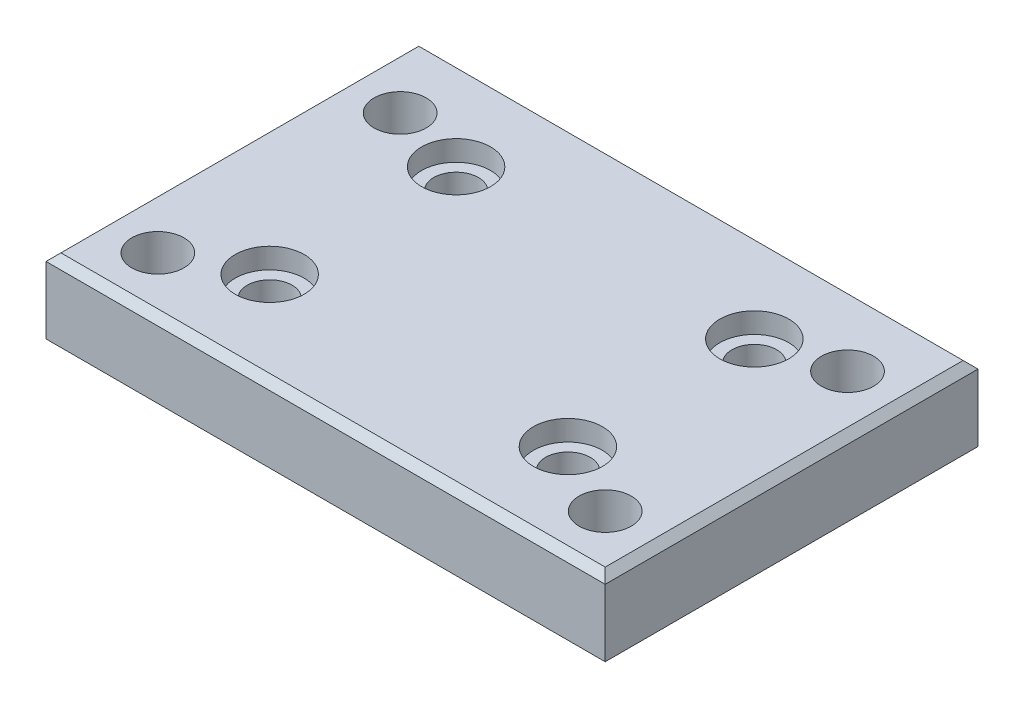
ISO-10303-21;
HEADER;
FILE_DESCRIPTION(('STEP AP214'),'2;1');
FILE_NAME('part.step','',(''),(''),'','','');
FILE_SCHEMA(('AUTOMOTIVE_DESIGN { 1 0 10303 214 1 1 1 1 }'));
ENDSEC;
DATA;
#1=APPLICATION_CONTEXT('core data for automotive mechanical design processes');
#2=APPLICATION_PROTOCOL_DEFINITION('international standard','automotive_design',2000,#1);
#3=PRODUCT_CONTEXT('',#1,'mechanical');
#4=PRODUCT('Part','Part','',(#3));
#5=PRODUCT_RELATED_PRODUCT_CATEGORY('part','',(#4));
#6=PRODUCT_DEFINITION_FORMATION('','',#4);
#7=PRODUCT_DEFINITION_CONTEXT('part definition',#1,'design');
#8=PRODUCT_DEFINITION('design','',#6,#7);
#9=PRODUCT_DEFINITION_SHAPE('','',#8);
#10=(LENGTH_UNIT() NAMED_UNIT(*) SI_UNIT(.MILLI.,.METRE.));
#11=(NAMED_UNIT(*) PLANE_ANGLE_UNIT() SI_UNIT($,.RADIAN.));
#12=(NAMED_UNIT(*) SI_UNIT($,.STERADIAN.) SOLID_ANGLE_UNIT());
#13=UNCERTAINTY_MEASURE_WITH_UNIT(LENGTH_MEASURE(1.E-05),#10,'distance_accuracy_value','');
#14=(GEOMETRIC_REPRESENTATION_CONTEXT(3) GLOBAL_UNCERTAINTY_ASSIGNED_CONTEXT((#13)) GLOBAL_UNIT_ASSIGNED_CONTEXT((#10,
#11,#12)) REPRESENTATION_CONTEXT('',''));
#15=CARTESIAN_POINT('',(0.,0.,0.));
#16=DIRECTION('',(0.,0.,1.));
#17=DIRECTION('',(1.,0.,0.));
#18=AXIS2_PLACEMENT_3D('',#15,#16,#17);
#19=CARTESIAN_POINT('',(-75.,20.,-50.));
#20=DIRECTION('',(1.,0.,0.));
#21=DIRECTION('',(0.,0.,-1.));
#22=AXIS2_PLACEMENT_3D('',#19,#20,#21);
#23=PLANE('',#22);
#24=DIRECTION('',(0.,-1.,0.));
#25=VECTOR('',#24,1.);
#26=CARTESIAN_POINT('',(-75.,20.,50.));
#27=LINE('',#26,#25);
#28=CARTESIAN_POINT('',(-75.,18.,50.));
#29=VERTEX_POINT('',#28);
#30=CARTESIAN_POINT('',(-75.,0.,50.));
#31=VERTEX_POINT('',#30);
#32=EDGE_CURVE('E88',#29,#31,#27,.T.);
#33=ORIENTED_EDGE('',*,*,#32,.F.);
#34=DIRECTION('',(0.,0.,-1.));
#35=VECTOR('',#34,1.);
#36=CARTESIAN_POINT('',(-75.,18.,-50.));
#37=LINE('',#36,#35);
#38=CARTESIAN_POINT('',(-75.,18.,-50.));
#39=VERTEX_POINT('',#38);
#40=EDGE_CURVE('E135',#29,#39,#37,.T.);
#41=ORIENTED_EDGE('',*,*,#40,.T.);
#42=DIRECTION('',(0.,-1.,0.));
#43=VECTOR('',#42,1.);
#44=CARTESIAN_POINT('',(-75.,20.,-50.));
#45=LINE('',#44,#43);
#46=CARTESIAN_POINT('',(-75.,0.,-50.));
#47=VERTEX_POINT('',#46);
#48=EDGE_CURVE('E111',#39,#47,#45,.T.);
#49=ORIENTED_EDGE('',*,*,#48,.T.);
#50=DIRECTION('',(0.,0.,1.));
#51=VECTOR('',#50,1.);
#52=CARTESIAN_POINT('',(-75.,0.,-50.));
#53=LINE('',#52,#51);
#54=EDGE_CURVE('E107',#47,#31,#53,.T.);
#55=ORIENTED_EDGE('',*,*,#54,.T.);
#56=EDGE_LOOP('',(#33,#41,#49,#55));
#57=FACE_BOUND('',#56,.T.);
#58=ADVANCED_FACE('F34',(#57),#23,.F.);
#59=CARTESIAN_POINT('',(-75.,20.,50.));
#60=DIRECTION('',(0.,0.,-1.));
#61=DIRECTION('',(-1.,0.,0.));
#62=AXIS2_PLACEMENT_3D('',#59,#60,#61);
#63=PLANE('',#62);
#64=DIRECTION('',(0.,-1.,0.));
#65=VECTOR('',#64,1.);
#66=CARTESIAN_POINT('',(75.,20.,50.));
#67=LINE('',#66,#65);
#68=CARTESIAN_POINT('',(75.,18.,50.));
#69=VERTEX_POINT('',#68);
#70=CARTESIAN_POINT('',(75.,0.,50.));
#71=VERTEX_POINT('',#70);
#72=EDGE_CURVE('E100',#69,#71,#67,.T.);
#73=ORIENTED_EDGE('',*,*,#72,.F.);
#74=DIRECTION('',(-1.,0.,0.));
#75=VECTOR('',#74,1.);
#76=CARTESIAN_POINT('',(-75.,18.,50.));
#77=LINE('',#76,#75);
#78=EDGE_CURVE('E94',#69,#29,#77,.T.);
#79=ORIENTED_EDGE('',*,*,#78,.T.);
#80=ORIENTED_EDGE('',*,*,#32,.T.);
#81=DIRECTION('',(1.,0.,0.));
#82=VECTOR('',#81,1.);
#83=CARTESIAN_POINT('',(-75.,0.,50.));
#84=LINE('',#83,#82);
#85=EDGE_CURVE('E91',#31,#71,#84,.T.);
#86=ORIENTED_EDGE('',*,*,#85,.T.);
#87=EDGE_LOOP('',(#73,#79,#80,#86));
#88=FACE_BOUND('',#87,.T.);
#89=ADVANCED_FACE('F90',(#88),#63,.F.);
#90=CARTESIAN_POINT('',(75.,20.,-50.));
#91=DIRECTION('',(-1.,0.,0.));
#92=DIRECTION('',(0.,0.,1.));
#93=AXIS2_PLACEMENT_3D('',#90,#91,#92);
#94=PLANE('',#93);
#95=DIRECTION('',(0.,-1.,0.));
#96=VECTOR('',#95,1.);
#97=CARTESIAN_POINT('',(75.,20.,-50.));
#98=LINE('',#97,#96);
#99=CARTESIAN_POINT('',(75.,18.,-50.));
#100=VERTEX_POINT('',#99);
#101=CARTESIAN_POINT('',(75.,0.,-50.));
#102=VERTEX_POINT('',#101);
#103=EDGE_CURVE('E124',#100,#102,#98,.T.);
#104=ORIENTED_EDGE('',*,*,#103,.F.);
#105=DIRECTION('',(0.,0.,1.));
#106=VECTOR('',#105,1.);
#107=CARTESIAN_POINT('',(75.,18.,50.));
#108=LINE('',#107,#106);
#109=EDGE_CURVE('E49',#100,#69,#108,.T.);
#110=ORIENTED_EDGE('',*,*,#109,.T.);
#111=ORIENTED_EDGE('',*,*,#72,.T.);
#112=DIRECTION('',(0.,0.,-1.));
#113=VECTOR('',#112,1.);
#114=CARTESIAN_POINT('',(75.,0.,-50.));
#115=LINE('',#114,#113);
#116=EDGE_CURVE('E109',#71,#102,#115,.T.);
#117=ORIENTED_EDGE('',*,*,#116,.T.);
#118=EDGE_LOOP('',(#104,#110,#111,#117));
#119=FACE_BOUND('',#118,.T.);
#120=ADVANCED_FACE('F181',(#119),#94,.F.);
#121=CARTESIAN_POINT('',(-75.,20.,-50.));
#122=DIRECTION('',(0.,0.,1.));
#123=DIRECTION('',(1.,0.,0.));
#124=AXIS2_PLACEMENT_3D('',#121,#122,#123);
#125=PLANE('',#124);
#126=ORIENTED_EDGE('',*,*,#48,.F.);
#127=DIRECTION('',(1.,0.,0.));
#128=VECTOR('',#127,1.);
#129=CARTESIAN_POINT('',(75.,18.,-50.));
#130=LINE('',#129,#128);
#131=EDGE_CURVE('E57',#39,#100,#130,.T.);
#132=ORIENTED_EDGE('',*,*,#131,.T.);
#133=ORIENTED_EDGE('',*,*,#103,.T.);
#134=DIRECTION('',(-1.,0.,0.));
#135=VECTOR('',#134,1.);
#136=CARTESIAN_POINT('',(-75.,0.,-50.));
#137=LINE('',#136,#135);
#138=EDGE_CURVE('E121',#102,#47,#137,.T.);
#139=ORIENTED_EDGE('',*,*,#138,.T.);
#140=EDGE_LOOP('',(#126,#132,#133,#139));
#141=FACE_BOUND('',#140,.T.);
#142=ADVANCED_FACE('F171',(#141),#125,.F.);
#143=CARTESIAN_POINT('',(-75.,20.,50.));
#144=DIRECTION('',(0.,1.,0.));
#145=DIRECTION('',(0.,0.,1.));
#146=AXIS2_PLACEMENT_3D('',#143,#144,#145);
#147=PLANE('',#146);
#148=CARTESIAN_POINT('',(60.,20.,-30.));
#149=DIRECTION('',(0.,1.,0.));
#150=DIRECTION('',(0.,0.,1.));
#151=AXIS2_PLACEMENT_3D('',#148,#149,#150);
#152=CIRCLE('',#151,6.99999999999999);
#153=CARTESIAN_POINT('',(60.,20.,-23.));
#154=VERTEX_POINT('',#153);
#155=EDGE_CURVE('E461',#154,#154,#152,.T.);
#156=ORIENTED_EDGE('',*,*,#155,.F.);
#157=EDGE_LOOP('',(#156));
#158=FACE_BOUND('',#157,.T.);
#159=CARTESIAN_POINT('',(-60.,20.,-30.));
#160=DIRECTION('',(0.,1.,0.));
#161=DIRECTION('',(0.,0.,1.));
#162=AXIS2_PLACEMENT_3D('',#159,#160,#161);
#163=CIRCLE('',#162,6.99999999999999);
#164=CARTESIAN_POINT('',(-60.,20.,-23.));
#165=VERTEX_POINT('',#164);
#166=EDGE_CURVE('E455',#165,#165,#163,.T.);
#167=ORIENTED_EDGE('',*,*,#166,.F.);
#168=EDGE_LOOP('',(#167));
#169=FACE_BOUND('',#168,.T.);
#170=CARTESIAN_POINT('',(60.,20.,35.));
#171=DIRECTION('',(0.,1.,0.));
#172=DIRECTION('',(0.,0.,1.));
#173=AXIS2_PLACEMENT_3D('',#170,#171,#172);
#174=CIRCLE('',#173,6.99999999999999);
#175=CARTESIAN_POINT('',(60.,20.,42.));
#176=VERTEX_POINT('',#175);
#177=EDGE_CURVE('E370',#176,#176,#174,.T.);
#178=ORIENTED_EDGE('',*,*,#177,.F.);
#179=EDGE_LOOP('',(#178));
#180=FACE_BOUND('',#179,.T.);
#181=CARTESIAN_POINT('',(-60.,20.,35.));
#182=DIRECTION('',(0.,1.,0.));
#183=DIRECTION('',(0.,0.,1.));
#184=AXIS2_PLACEMENT_3D('',#181,#182,#183);
#185=CIRCLE('',#184,6.99999999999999);
#186=CARTESIAN_POINT('',(-60.,20.,42.));
#187=VERTEX_POINT('',#186);
#188=EDGE_CURVE('E363',#187,#187,#185,.T.);
#189=ORIENTED_EDGE('',*,*,#188,.F.);
#190=EDGE_LOOP('',(#189));
#191=FACE_BOUND('',#190,.T.);
#192=CARTESIAN_POINT('',(40.,20.,25.));
#193=DIRECTION('',(0.,1.,0.));
#194=DIRECTION('',(0.,0.,1.));
#195=AXIS2_PLACEMENT_3D('',#192,#193,#194);
#196=CIRCLE('',#195,9.24999999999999);
#197=CARTESIAN_POINT('',(40.,20.,34.25));
#198=VERTEX_POINT('',#197);
#199=EDGE_CURVE('E368',#198,#198,#196,.T.);
#200=ORIENTED_EDGE('',*,*,#199,.F.);
#201=EDGE_LOOP('',(#200));
#202=FACE_BOUND('',#201,.T.);
#203=CARTESIAN_POINT('',(-40.,20.,25.));
#204=DIRECTION('',(0.,1.,0.));
#205=DIRECTION('',(0.,0.,1.));
#206=AXIS2_PLACEMENT_3D('',#203,#204,#205);
#207=CIRCLE('',#206,9.24999999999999);
#208=CARTESIAN_POINT('',(-40.,20.,34.25));
#209=VERTEX_POINT('',#208);
#210=EDGE_CURVE('E391',#209,#209,#207,.T.);
#211=ORIENTED_EDGE('',*,*,#210,.F.);
#212=EDGE_LOOP('',(#211));
#213=FACE_BOUND('',#212,.T.);
#214=DIRECTION('',(-1.,0.,0.));
#215=VECTOR('',#214,1.);
#216=CARTESIAN_POINT('',(-75.,20.,-48.));
#217=LINE('',#216,#215);
#218=CARTESIAN_POINT('',(73.,20.,-48.));
#219=VERTEX_POINT('',#218);
#220=CARTESIAN_POINT('',(-73.,20.,-48.));
#221=VERTEX_POINT('',#220);
#222=EDGE_CURVE('E130',#219,#221,#217,.T.);
#223=ORIENTED_EDGE('',*,*,#222,.T.);
#224=DIRECTION('',(0.,0.,1.));
#225=VECTOR('',#224,1.);
#226=CARTESIAN_POINT('',(-73.,20.,50.));
#227=LINE('',#226,#225);
#228=CARTESIAN_POINT('',(-73.,20.,48.));
#229=VERTEX_POINT('',#228);
#230=EDGE_CURVE('E132',#221,#229,#227,.T.);
#231=ORIENTED_EDGE('',*,*,#230,.T.);
#232=DIRECTION('',(1.,0.,0.));
#233=VECTOR('',#232,1.);
#234=CARTESIAN_POINT('',(75.,20.,48.));
#235=LINE('',#234,#233);
#236=CARTESIAN_POINT('',(73.,20.,48.));
#237=VERTEX_POINT('',#236);
#238=EDGE_CURVE('E99',#229,#237,#235,.T.);
#239=ORIENTED_EDGE('',*,*,#238,.T.);
#240=DIRECTION('',(0.,0.,-1.));
#241=VECTOR('',#240,1.);
#242=CARTESIAN_POINT('',(73.,20.,-50.));
#243=LINE('',#242,#241);
#244=EDGE_CURVE('E128',#237,#219,#243,.T.);
#245=ORIENTED_EDGE('',*,*,#244,.T.);
#246=EDGE_LOOP('',(#223,#231,#239,#245));
#247=FACE_BOUND('',#246,.T.);
#248=CARTESIAN_POINT('',(-40.,20.,-25.));
#249=DIRECTION('',(0.,1.,0.));
#250=DIRECTION('',(0.,0.,1.));
#251=AXIS2_PLACEMENT_3D('',#248,#249,#250);
#252=CIRCLE('',#251,9.24999999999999);
#253=CARTESIAN_POINT('',(-40.,20.,-15.75));
#254=VERTEX_POINT('',#253);
#255=EDGE_CURVE('E143',#254,#254,#252,.T.);
#256=ORIENTED_EDGE('',*,*,#255,.F.);
#257=EDGE_LOOP('',(#256));
#258=FACE_BOUND('',#257,.T.);
#259=CARTESIAN_POINT('',(40.,20.,-25.));
#260=DIRECTION('',(0.,1.,0.));
#261=DIRECTION('',(0.,0.,1.));
#262=AXIS2_PLACEMENT_3D('',#259,#260,#261);
#263=CIRCLE('',#262,9.24999999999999);
#264=CARTESIAN_POINT('',(40.,20.,-15.75));
#265=VERTEX_POINT('',#264);
#266=EDGE_CURVE('E155',#265,#265,#263,.T.);
#267=ORIENTED_EDGE('',*,*,#266,.F.);
#268=EDGE_LOOP('',(#267));
#269=FACE_BOUND('',#268,.T.);
#270=ADVANCED_FACE('F169',(#158,#169,#180,#191,#202,#213,#247,#258,#269),#147,.T.);
#271=CARTESIAN_POINT('',(-75.,0.,50.));
#272=DIRECTION('',(0.,1.,0.));
#273=DIRECTION('',(0.,0.,1.));
#274=AXIS2_PLACEMENT_3D('',#271,#272,#273);
#275=PLANE('',#274);
#276=CARTESIAN_POINT('',(60.,0.,-30.));
#277=DIRECTION('',(0.,1.,0.));
#278=DIRECTION('',(0.,0.,1.));
#279=AXIS2_PLACEMENT_3D('',#276,#277,#278);
#280=CIRCLE('',#279,6.99999999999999);
#281=CARTESIAN_POINT('',(60.,0.,-23.));
#282=VERTEX_POINT('',#281);
#283=EDGE_CURVE('E464',#282,#282,#280,.T.);
#284=ORIENTED_EDGE('',*,*,#283,.T.);
#285=EDGE_LOOP('',(#284));
#286=FACE_BOUND('',#285,.T.);
#287=CARTESIAN_POINT('',(-60.,0.,-30.));
#288=DIRECTION('',(0.,1.,0.));
#289=DIRECTION('',(0.,0.,1.));
#290=AXIS2_PLACEMENT_3D('',#287,#288,#289);
#291=CIRCLE('',#290,6.99999999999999);
#292=CARTESIAN_POINT('',(-60.,0.,-23.));
#293=VERTEX_POINT('',#292);
#294=EDGE_CURVE('E458',#293,#293,#291,.T.);
#295=ORIENTED_EDGE('',*,*,#294,.T.);
#296=EDGE_LOOP('',(#295));
#297=FACE_BOUND('',#296,.T.);
#298=CARTESIAN_POINT('',(60.,0.,35.));
#299=DIRECTION('',(0.,1.,0.));
#300=DIRECTION('',(0.,0.,1.));
#301=AXIS2_PLACEMENT_3D('',#298,#299,#300);
#302=CIRCLE('',#301,6.99999999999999);
#303=CARTESIAN_POINT('',(60.,0.,42.));
#304=VERTEX_POINT('',#303);
#305=EDGE_CURVE('E452',#304,#304,#302,.T.);
#306=ORIENTED_EDGE('',*,*,#305,.T.);
#307=EDGE_LOOP('',(#306));
#308=FACE_BOUND('',#307,.T.);
#309=CARTESIAN_POINT('',(-60.,0.,35.));
#310=DIRECTION('',(0.,1.,0.));
#311=DIRECTION('',(0.,0.,1.));
#312=AXIS2_PLACEMENT_3D('',#309,#310,#311);
#313=CIRCLE('',#312,6.99999999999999);
#314=CARTESIAN_POINT('',(-60.,0.,42.));
#315=VERTEX_POINT('',#314);
#316=EDGE_CURVE('E360',#315,#315,#313,.T.);
#317=ORIENTED_EDGE('',*,*,#316,.T.);
#318=EDGE_LOOP('',(#317));
#319=FACE_BOUND('',#318,.T.);
#320=CARTESIAN_POINT('',(40.,0.,25.));
#321=DIRECTION('',(0.,1.,0.));
#322=DIRECTION('',(0.,0.,1.));
#323=AXIS2_PLACEMENT_3D('',#320,#321,#322);
#324=CIRCLE('',#323,6.);
#325=CARTESIAN_POINT('',(40.,0.,31.));
#326=VERTEX_POINT('',#325);
#327=EDGE_CURVE('E365',#326,#326,#324,.T.);
#328=ORIENTED_EDGE('',*,*,#327,.T.);
#329=EDGE_LOOP('',(#328));
#330=FACE_BOUND('',#329,.T.);
#331=CARTESIAN_POINT('',(-40.,0.,25.));
#332=DIRECTION('',(0.,1.,0.));
#333=DIRECTION('',(0.,0.,1.));
#334=AXIS2_PLACEMENT_3D('',#331,#332,#333);
#335=CIRCLE('',#334,6.);
#336=CARTESIAN_POINT('',(-40.,0.,31.));
#337=VERTEX_POINT('',#336);
#338=EDGE_CURVE('E382',#337,#337,#335,.T.);
#339=ORIENTED_EDGE('',*,*,#338,.T.);
#340=EDGE_LOOP('',(#339));
#341=FACE_BOUND('',#340,.T.);
#342=ORIENTED_EDGE('',*,*,#54,.F.);
#343=ORIENTED_EDGE('',*,*,#138,.F.);
#344=ORIENTED_EDGE('',*,*,#116,.F.);
#345=ORIENTED_EDGE('',*,*,#85,.F.);
#346=EDGE_LOOP('',(#342,#343,#344,#345));
#347=FACE_BOUND('',#346,.T.);
#348=CARTESIAN_POINT('',(-40.,0.,-25.));
#349=DIRECTION('',(0.,1.,0.));
#350=DIRECTION('',(0.,0.,1.));
#351=AXIS2_PLACEMENT_3D('',#348,#349,#350);
#352=CIRCLE('',#351,6.);
#353=CARTESIAN_POINT('',(-40.,0.,-19.));
#354=VERTEX_POINT('',#353);
#355=EDGE_CURVE('E140',#354,#354,#352,.T.);
#356=ORIENTED_EDGE('',*,*,#355,.T.);
#357=EDGE_LOOP('',(#356));
#358=FACE_BOUND('',#357,.T.);
#359=CARTESIAN_POINT('',(40.,0.,-25.));
#360=DIRECTION('',(0.,1.,0.));
#361=DIRECTION('',(0.,0.,1.));
#362=AXIS2_PLACEMENT_3D('',#359,#360,#361);
#363=CIRCLE('',#362,6.);
#364=CARTESIAN_POINT('',(40.,0.,-19.));
#365=VERTEX_POINT('',#364);
#366=EDGE_CURVE('E152',#365,#365,#363,.T.);
#367=ORIENTED_EDGE('',*,*,#366,.T.);
#368=EDGE_LOOP('',(#367));
#369=FACE_BOUND('',#368,.T.);
#370=ADVANCED_FACE('F104',(#286,#297,#308,#319,#330,#341,#347,#358,#369),#275,.F.);
#371=CARTESIAN_POINT('',(73.,20.,50.));
#372=DIRECTION('',(0.707106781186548,0.707106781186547,0.));
#373=DIRECTION('',(-0.707106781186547,0.707106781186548,0.));
#374=AXIS2_PLACEMENT_3D('',#371,#372,#373);
#375=PLANE('',#374);
#376=DIRECTION('',(-0.577350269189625,0.577350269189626,-0.577350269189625));
#377=VECTOR('',#376,1.);
#378=CARTESIAN_POINT('',(23.6666666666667,69.3333333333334,-1.33333333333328));
#379=LINE('',#378,#377);
#380=EDGE_CURVE('E116',#69,#237,#379,.T.);
#381=ORIENTED_EDGE('',*,*,#380,.F.);
#382=ORIENTED_EDGE('',*,*,#109,.F.);
#383=DIRECTION('',(-0.577350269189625,0.577350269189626,0.577350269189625));
#384=VECTOR('',#383,1.);
#385=CARTESIAN_POINT('',(40.3333333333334,52.6666666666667,-15.3333333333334));
#386=LINE('',#385,#384);
#387=EDGE_CURVE('E113',#219,#100,#386,.F.);
#388=ORIENTED_EDGE('',*,*,#387,.F.);
#389=ORIENTED_EDGE('',*,*,#244,.F.);
#390=EDGE_LOOP('',(#381,#382,#388,#389));
#391=FACE_BOUND('',#390,.T.);
#392=ADVANCED_FACE('F178',(#391),#375,.T.);
#393=CARTESIAN_POINT('',(-75.,20.,-48.));
#394=DIRECTION('',(0.,0.707106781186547,-0.707106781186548));
#395=DIRECTION('',(0.,0.707106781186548,0.707106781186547));
#396=AXIS2_PLACEMENT_3D('',#393,#394,#395);
#397=PLANE('',#396);
#398=ORIENTED_EDGE('',*,*,#387,.T.);
#399=ORIENTED_EDGE('',*,*,#131,.F.);
#400=DIRECTION('',(0.577350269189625,0.577350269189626,0.577350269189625));
#401=VECTOR('',#400,1.);
#402=CARTESIAN_POINT('',(-73.6666666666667,19.3333333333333,-48.6666666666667));
#403=LINE('',#402,#401);
#404=EDGE_CURVE('E396',#221,#39,#403,.F.);
#405=ORIENTED_EDGE('',*,*,#404,.F.);
#406=ORIENTED_EDGE('',*,*,#222,.F.);
#407=EDGE_LOOP('',(#398,#399,#405,#406));
#408=FACE_BOUND('',#407,.T.);
#409=ADVANCED_FACE('F291',(#408),#397,.T.);
#410=CARTESIAN_POINT('',(-75.,20.,48.));
#411=DIRECTION('',(0.,0.707106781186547,0.707106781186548));
#412=DIRECTION('',(0.,-0.707106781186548,0.707106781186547));
#413=AXIS2_PLACEMENT_3D('',#410,#411,#412);
#414=PLANE('',#413);
#415=ORIENTED_EDGE('',*,*,#380,.T.);
#416=ORIENTED_EDGE('',*,*,#238,.F.);
#417=DIRECTION('',(-0.577350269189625,-0.577350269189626,0.577350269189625));
#418=VECTOR('',#417,1.);
#419=CARTESIAN_POINT('',(-73.6666666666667,19.3333333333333,48.6666666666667));
#420=LINE('',#419,#418);
#421=EDGE_CURVE('E394',#29,#229,#420,.F.);
#422=ORIENTED_EDGE('',*,*,#421,.F.);
#423=ORIENTED_EDGE('',*,*,#78,.F.);
#424=EDGE_LOOP('',(#415,#416,#422,#423));
#425=FACE_BOUND('',#424,.T.);
#426=ADVANCED_FACE('F283',(#425),#414,.T.);
#427=CARTESIAN_POINT('',(-73.,20.,50.));
#428=DIRECTION('',(-0.707106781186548,0.707106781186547,0.));
#429=DIRECTION('',(-0.707106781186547,-0.707106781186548,0.));
#430=AXIS2_PLACEMENT_3D('',#427,#428,#429);
#431=PLANE('',#430);
#432=ORIENTED_EDGE('',*,*,#404,.T.);
#433=ORIENTED_EDGE('',*,*,#40,.F.);
#434=ORIENTED_EDGE('',*,*,#421,.T.);
#435=ORIENTED_EDGE('',*,*,#230,.F.);
#436=EDGE_LOOP('',(#432,#433,#434,#435));
#437=FACE_BOUND('',#436,.T.);
#438=ADVANCED_FACE('F275',(#437),#431,.T.);
#439=CARTESIAN_POINT('',(-40.,20.,25.));
#440=DIRECTION('',(0.,1.,0.));
#441=DIRECTION('',(0.,0.,1.));
#442=AXIS2_PLACEMENT_3D('',#439,#440,#441);
#443=CYLINDRICAL_SURFACE('',#442,9.24999999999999);
#444=CARTESIAN_POINT('',(-40.,14.5,25.));
#445=DIRECTION('',(0.,1.,0.));
#446=DIRECTION('',(0.,0.,1.));
#447=AXIS2_PLACEMENT_3D('',#444,#445,#446);
#448=CIRCLE('',#447,9.24999999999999);
#449=CARTESIAN_POINT('',(-40.,14.5,34.25));
#450=VERTEX_POINT('',#449);
#451=EDGE_CURVE('E388',#450,#450,#448,.T.);
#452=ORIENTED_EDGE('',*,*,#451,.F.);
#453=EDGE_LOOP('',(#452));
#454=FACE_BOUND('',#453,.T.);
#455=ORIENTED_EDGE('',*,*,#210,.T.);
#456=EDGE_LOOP('',(#455));
#457=FACE_BOUND('',#456,.T.);
#458=ADVANCED_FACE('F267',(#454,#457),#443,.F.);
#459=CARTESIAN_POINT('',(-34.,14.5,25.));
#460=DIRECTION('',(0.,-1.,0.));
#461=DIRECTION('',(0.,0.,-1.));
#462=AXIS2_PLACEMENT_3D('',#459,#460,#461);
#463=PLANE('',#462);
#464=CARTESIAN_POINT('',(-40.,14.5,25.));
#465=DIRECTION('',(0.,1.,0.));
#466=DIRECTION('',(0.,0.,1.));
#467=AXIS2_PLACEMENT_3D('',#464,#465,#466);
#468=CIRCLE('',#467,6.);
#469=CARTESIAN_POINT('',(-40.,14.5,31.));
#470=VERTEX_POINT('',#469);
#471=EDGE_CURVE('E385',#470,#470,#468,.T.);
#472=ORIENTED_EDGE('',*,*,#471,.F.);
#473=EDGE_LOOP('',(#472));
#474=FACE_BOUND('',#473,.T.);
#475=ORIENTED_EDGE('',*,*,#451,.T.);
#476=EDGE_LOOP('',(#475));
#477=FACE_BOUND('',#476,.T.);
#478=ADVANCED_FACE('F259',(#474,#477),#463,.F.);
#479=CARTESIAN_POINT('',(-40.,20.,25.));
#480=DIRECTION('',(0.,1.,0.));
#481=DIRECTION('',(0.,0.,1.));
#482=AXIS2_PLACEMENT_3D('',#479,#480,#481);
#483=CYLINDRICAL_SURFACE('',#482,6.);
#484=ORIENTED_EDGE('',*,*,#338,.F.);
#485=EDGE_LOOP('',(#484));
#486=FACE_BOUND('',#485,.T.);
#487=ORIENTED_EDGE('',*,*,#471,.T.);
#488=EDGE_LOOP('',(#487));
#489=FACE_BOUND('',#488,.T.);
#490=ADVANCED_FACE('F239',(#486,#489),#483,.F.);
#491=CARTESIAN_POINT('',(40.,20.,25.));
#492=DIRECTION('',(0.,1.,0.));
#493=DIRECTION('',(0.,0.,1.));
#494=AXIS2_PLACEMENT_3D('',#491,#492,#493);
#495=CYLINDRICAL_SURFACE('',#494,9.24999999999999);
#496=CARTESIAN_POINT('',(40.,14.5,25.));
#497=DIRECTION('',(0.,1.,0.));
#498=DIRECTION('',(0.,0.,1.));
#499=AXIS2_PLACEMENT_3D('',#496,#497,#498);
#500=CIRCLE('',#499,9.24999999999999);
#501=CARTESIAN_POINT('',(40.,14.5,34.25));
#502=VERTEX_POINT('',#501);
#503=EDGE_CURVE('E379',#502,#502,#500,.T.);
#504=ORIENTED_EDGE('',*,*,#503,.F.);
#505=EDGE_LOOP('',(#504));
#506=FACE_BOUND('',#505,.T.);
#507=ORIENTED_EDGE('',*,*,#199,.T.);
#508=EDGE_LOOP('',(#507));
#509=FACE_BOUND('',#508,.T.);
#510=ADVANCED_FACE('F205',(#506,#509),#495,.F.);
#511=CARTESIAN_POINT('',(46.,14.5,25.));
#512=DIRECTION('',(0.,-1.,0.));
#513=DIRECTION('',(0.,0.,-1.));
#514=AXIS2_PLACEMENT_3D('',#511,#512,#513);
#515=PLANE('',#514);
#516=CARTESIAN_POINT('',(40.,14.5,25.));
#517=DIRECTION('',(0.,1.,0.));
#518=DIRECTION('',(0.,0.,1.));
#519=AXIS2_PLACEMENT_3D('',#516,#517,#518);
#520=CIRCLE('',#519,6.);
#521=CARTESIAN_POINT('',(40.,14.5,31.));
#522=VERTEX_POINT('',#521);
#523=EDGE_CURVE('E376',#522,#522,#520,.T.);
#524=ORIENTED_EDGE('',*,*,#523,.F.);
#525=EDGE_LOOP('',(#524));
#526=FACE_BOUND('',#525,.T.);
#527=ORIENTED_EDGE('',*,*,#503,.T.);
#528=EDGE_LOOP('',(#527));
#529=FACE_BOUND('',#528,.T.);
#530=ADVANCED_FACE('F236',(#526,#529),#515,.F.);
#531=CARTESIAN_POINT('',(40.,20.,25.));
#532=DIRECTION('',(0.,1.,0.));
#533=DIRECTION('',(0.,0.,1.));
#534=AXIS2_PLACEMENT_3D('',#531,#532,#533);
#535=CYLINDRICAL_SURFACE('',#534,6.);
#536=ORIENTED_EDGE('',*,*,#327,.F.);
#537=EDGE_LOOP('',(#536));
#538=FACE_BOUND('',#537,.T.);
#539=ORIENTED_EDGE('',*,*,#523,.T.);
#540=EDGE_LOOP('',(#539));
#541=FACE_BOUND('',#540,.T.);
#542=ADVANCED_FACE('F203',(#538,#541),#535,.F.);
#543=CARTESIAN_POINT('',(-40.,20.,-25.));
#544=DIRECTION('',(0.,1.,0.));
#545=DIRECTION('',(0.,0.,1.));
#546=AXIS2_PLACEMENT_3D('',#543,#544,#545);
#547=CYLINDRICAL_SURFACE('',#546,6.);
#548=ORIENTED_EDGE('',*,*,#355,.F.);
#549=EDGE_LOOP('',(#548));
#550=FACE_BOUND('',#549,.T.);
#551=CARTESIAN_POINT('',(-40.,14.5,-25.));
#552=DIRECTION('',(0.,1.,0.));
#553=DIRECTION('',(0.,0.,1.));
#554=AXIS2_PLACEMENT_3D('',#551,#552,#553);
#555=CIRCLE('',#554,6.);
#556=CARTESIAN_POINT('',(-40.,14.5,-19.));
#557=VERTEX_POINT('',#556);
#558=EDGE_CURVE('E149',#557,#557,#555,.T.);
#559=ORIENTED_EDGE('',*,*,#558,.T.);
#560=EDGE_LOOP('',(#559));
#561=FACE_BOUND('',#560,.T.);
#562=ADVANCED_FACE('F200',(#550,#561),#547,.F.);
#563=CARTESIAN_POINT('',(-34.,14.5,-25.));
#564=DIRECTION('',(0.,-1.,0.));
#565=DIRECTION('',(0.,0.,-1.));
#566=AXIS2_PLACEMENT_3D('',#563,#564,#565);
#567=PLANE('',#566);
#568=ORIENTED_EDGE('',*,*,#558,.F.);
#569=EDGE_LOOP('',(#568));
#570=FACE_BOUND('',#569,.T.);
#571=CARTESIAN_POINT('',(-40.,14.5,-25.));
#572=DIRECTION('',(0.,1.,0.));
#573=DIRECTION('',(0.,0.,1.));
#574=AXIS2_PLACEMENT_3D('',#571,#572,#573);
#575=CIRCLE('',#574,9.24999999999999);
#576=CARTESIAN_POINT('',(-40.,14.5,-15.75));
#577=VERTEX_POINT('',#576);
#578=EDGE_CURVE('E146',#577,#577,#575,.T.);
#579=ORIENTED_EDGE('',*,*,#578,.T.);
#580=EDGE_LOOP('',(#579));
#581=FACE_BOUND('',#580,.T.);
#582=ADVANCED_FACE('F196',(#570,#581),#567,.F.);
#583=CARTESIAN_POINT('',(-40.,20.,-25.));
#584=DIRECTION('',(0.,1.,0.));
#585=DIRECTION('',(0.,0.,1.));
#586=AXIS2_PLACEMENT_3D('',#583,#584,#585);
#587=CYLINDRICAL_SURFACE('',#586,9.24999999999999);
#588=ORIENTED_EDGE('',*,*,#578,.F.);
#589=EDGE_LOOP('',(#588));
#590=FACE_BOUND('',#589,.T.);
#591=ORIENTED_EDGE('',*,*,#255,.T.);
#592=EDGE_LOOP('',(#591));
#593=FACE_BOUND('',#592,.T.);
#594=ADVANCED_FACE('F193',(#590,#593),#587,.F.);
#595=CARTESIAN_POINT('',(40.,20.,-25.));
#596=DIRECTION('',(0.,1.,0.));
#597=DIRECTION('',(0.,0.,1.));
#598=AXIS2_PLACEMENT_3D('',#595,#596,#597);
#599=CYLINDRICAL_SURFACE('',#598,6.);
#600=ORIENTED_EDGE('',*,*,#366,.F.);
#601=EDGE_LOOP('',(#600));
#602=FACE_BOUND('',#601,.T.);
#603=CARTESIAN_POINT('',(40.,14.5,-25.));
#604=DIRECTION('',(0.,1.,0.));
#605=DIRECTION('',(0.,0.,1.));
#606=AXIS2_PLACEMENT_3D('',#603,#604,#605);
#607=CIRCLE('',#606,6.);
#608=CARTESIAN_POINT('',(40.,14.5,-19.));
#609=VERTEX_POINT('',#608);
#610=EDGE_CURVE('E11',#609,#609,#607,.T.);
#611=ORIENTED_EDGE('',*,*,#610,.T.);
#612=EDGE_LOOP('',(#611));
#613=FACE_BOUND('',#612,.T.);
#614=ADVANCED_FACE('F36',(#602,#613),#599,.F.);
#615=CARTESIAN_POINT('',(46.,14.5,-25.));
#616=DIRECTION('',(0.,-1.,0.));
#617=DIRECTION('',(0.,0.,-1.));
#618=AXIS2_PLACEMENT_3D('',#615,#616,#617);
#619=PLANE('',#618);
#620=ORIENTED_EDGE('',*,*,#610,.F.);
#621=EDGE_LOOP('',(#620));
#622=FACE_BOUND('',#621,.T.);
#623=CARTESIAN_POINT('',(40.,14.5,-25.));
#624=DIRECTION('',(0.,1.,0.));
#625=DIRECTION('',(0.,0.,1.));
#626=AXIS2_PLACEMENT_3D('',#623,#624,#625);
#627=CIRCLE('',#626,9.24999999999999);
#628=CARTESIAN_POINT('',(40.,14.5,-15.75));
#629=VERTEX_POINT('',#628);
#630=EDGE_CURVE('E42',#629,#629,#627,.T.);
#631=ORIENTED_EDGE('',*,*,#630,.T.);
#632=EDGE_LOOP('',(#631));
#633=FACE_BOUND('',#632,.T.);
#634=ADVANCED_FACE('F160',(#622,#633),#619,.F.);
#635=CARTESIAN_POINT('',(40.,20.,-25.));
#636=DIRECTION('',(0.,1.,0.));
#637=DIRECTION('',(0.,0.,1.));
#638=AXIS2_PLACEMENT_3D('',#635,#636,#637);
#639=CYLINDRICAL_SURFACE('',#638,9.24999999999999);
#640=ORIENTED_EDGE('',*,*,#630,.F.);
#641=EDGE_LOOP('',(#640));
#642=FACE_BOUND('',#641,.T.);
#643=ORIENTED_EDGE('',*,*,#266,.T.);
#644=EDGE_LOOP('',(#643));
#645=FACE_BOUND('',#644,.T.);
#646=ADVANCED_FACE('F162',(#642,#645),#639,.F.);
#647=CARTESIAN_POINT('',(-60.,20.,35.));
#648=DIRECTION('',(0.,1.,0.));
#649=DIRECTION('',(0.,0.,1.));
#650=AXIS2_PLACEMENT_3D('',#647,#648,#649);
#651=CYLINDRICAL_SURFACE('',#650,6.99999999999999);
#652=ORIENTED_EDGE('',*,*,#316,.F.);
#653=EDGE_LOOP('',(#652));
#654=FACE_BOUND('',#653,.T.);
#655=ORIENTED_EDGE('',*,*,#188,.T.);
#656=EDGE_LOOP('',(#655));
#657=FACE_BOUND('',#656,.T.);
#658=ADVANCED_FACE('F165',(#654,#657),#651,.F.);
#659=CARTESIAN_POINT('',(60.,20.,35.));
#660=DIRECTION('',(0.,1.,0.));
#661=DIRECTION('',(0.,0.,1.));
#662=AXIS2_PLACEMENT_3D('',#659,#660,#661);
#663=CYLINDRICAL_SURFACE('',#662,6.99999999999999);
#664=ORIENTED_EDGE('',*,*,#305,.F.);
#665=EDGE_LOOP('',(#664));
#666=FACE_BOUND('',#665,.T.);
#667=ORIENTED_EDGE('',*,*,#177,.T.);
#668=EDGE_LOOP('',(#667));
#669=FACE_BOUND('',#668,.T.);
#670=ADVANCED_FACE('F320',(#666,#669),#663,.F.);
#671=CARTESIAN_POINT('',(-60.,20.,-30.));
#672=DIRECTION('',(0.,1.,0.));
#673=DIRECTION('',(0.,0.,1.));
#674=AXIS2_PLACEMENT_3D('',#671,#672,#673);
#675=CYLINDRICAL_SURFACE('',#674,6.99999999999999);
#676=ORIENTED_EDGE('',*,*,#294,.F.);
#677=EDGE_LOOP('',(#676));
#678=FACE_BOUND('',#677,.T.);
#679=ORIENTED_EDGE('',*,*,#166,.T.);
#680=EDGE_LOOP('',(#679));
#681=FACE_BOUND('',#680,.T.);
#682=ADVANCED_FACE('F325',(#678,#681),#675,.F.);
#683=CARTESIAN_POINT('',(60.,20.,-30.));
#684=DIRECTION('',(0.,1.,0.));
#685=DIRECTION('',(0.,0.,1.));
#686=AXIS2_PLACEMENT_3D('',#683,#684,#685);
#687=CYLINDRICAL_SURFACE('',#686,6.99999999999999);
#688=ORIENTED_EDGE('',*,*,#283,.F.);
#689=EDGE_LOOP('',(#688));
#690=FACE_BOUND('',#689,.T.);
#691=ORIENTED_EDGE('',*,*,#155,.T.);
#692=EDGE_LOOP('',(#691));
#693=FACE_BOUND('',#692,.T.);
#694=ADVANCED_FACE('F337',(#690,#693),#687,.F.);
#695=CLOSED_SHELL('',(#58,#89,#120,#142,#270,#370,#392,#409,#426,#438,#458,#478,#490,#510,#530,
#542,#562,#582,#594,#614,#634,#646,#658,#670,#682,#694));
#696=MANIFOLD_SOLID_BREP('B2',#695);
#697=ADVANCED_BREP_SHAPE_REPRESENTATION('',(#18,#696),#14);
#698=SHAPE_DEFINITION_REPRESENTATION(#9,#697);
ENDSEC;
END-ISO-10303-21;
